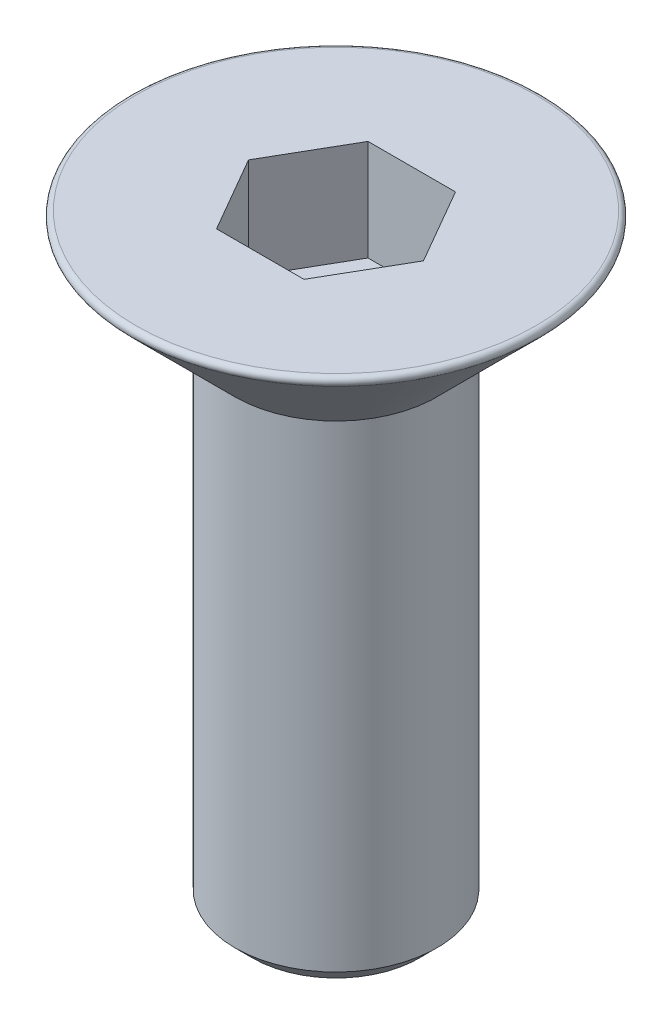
ISO-10303-21;
HEADER;
FILE_DESCRIPTION(('STEP AP214'),'2;1');
FILE_NAME('part.step','',(''),(''),'','','');
FILE_SCHEMA(('AUTOMOTIVE_DESIGN { 1 0 10303 214 1 1 1 1 }'));
ENDSEC;
DATA;
#1=APPLICATION_CONTEXT('core data for automotive mechanical design processes');
#2=APPLICATION_PROTOCOL_DEFINITION('international standard','automotive_design',2000,#1);
#3=PRODUCT_CONTEXT('',#1,'mechanical');
#4=PRODUCT('Part','Part','',(#3));
#5=PRODUCT_RELATED_PRODUCT_CATEGORY('part','',(#4));
#6=PRODUCT_DEFINITION_FORMATION('','',#4);
#7=PRODUCT_DEFINITION_CONTEXT('part definition',#1,'design');
#8=PRODUCT_DEFINITION('design','',#6,#7);
#9=PRODUCT_DEFINITION_SHAPE('','',#8);
#10=(LENGTH_UNIT() NAMED_UNIT(*) SI_UNIT(.MILLI.,.METRE.));
#11=(NAMED_UNIT(*) PLANE_ANGLE_UNIT() SI_UNIT($,.RADIAN.));
#12=(NAMED_UNIT(*) SI_UNIT($,.STERADIAN.) SOLID_ANGLE_UNIT());
#13=UNCERTAINTY_MEASURE_WITH_UNIT(LENGTH_MEASURE(1.E-05),#10,'distance_accuracy_value','');
#14=(GEOMETRIC_REPRESENTATION_CONTEXT(3) GLOBAL_UNCERTAINTY_ASSIGNED_CONTEXT((#13)) GLOBAL_UNIT_ASSIGNED_CONTEXT((#10,
#11,#12)) REPRESENTATION_CONTEXT('',''));
#15=CARTESIAN_POINT('',(0.,0.,0.));
#16=DIRECTION('',(0.,0.,1.));
#17=DIRECTION('',(1.,0.,0.));
#18=AXIS2_PLACEMENT_3D('',#15,#16,#17);
#19=CARTESIAN_POINT('',(0.,0.,0.));
#20=DIRECTION('',(0.,1.,0.));
#21=DIRECTION('',(0.,0.,1.));
#22=AXIS2_PLACEMENT_3D('',#19,#20,#21);
#23=PLANE('',#22);
#24=CARTESIAN_POINT('',(0.,0.,0.));
#25=DIRECTION('',(0.,1.,0.));
#26=DIRECTION('',(0.,0.,1.));
#27=AXIS2_PLACEMENT_3D('',#24,#25,#26);
#28=CIRCLE('',#27,3.95857864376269);
#29=CARTESIAN_POINT('',(0.,0.,3.95857864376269));
#30=VERTEX_POINT('',#29);
#31=EDGE_CURVE('E35',#30,#30,#28,.T.);
#32=ORIENTED_EDGE('',*,*,#31,.T.);
#33=EDGE_LOOP('',(#32));
#34=FACE_BOUND('',#33,.T.);
#35=DIRECTION('',(1.,0.,0.));
#36=VECTOR('',#35,1.);
#37=CARTESIAN_POINT('',(-0.866025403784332,-5.6843418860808E-11,1.5));
#38=LINE('',#37,#36);
#39=CARTESIAN_POINT('',(-0.866025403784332,-5.6843418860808E-11,1.5));
#40=VERTEX_POINT('',#39);
#41=CARTESIAN_POINT('',(0.866025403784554,-1.11022302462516E-13,1.5));
#42=VERTEX_POINT('',#41);
#43=EDGE_CURVE('E42',#40,#42,#38,.T.);
#44=ORIENTED_EDGE('',*,*,#43,.F.);
#45=DIRECTION('',(-0.5,0.,-0.866025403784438));
#46=VECTOR('',#45,1.);
#47=CARTESIAN_POINT('',(-0.866025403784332,-5.6843418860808E-11,1.5));
#48=LINE('',#47,#46);
#49=CARTESIAN_POINT('',(-1.73205080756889,-5.67323965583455E-11,0.));
#50=VERTEX_POINT('',#49);
#51=EDGE_CURVE('E110',#40,#50,#48,.T.);
#52=ORIENTED_EDGE('',*,*,#51,.T.);
#53=DIRECTION('',(-0.5,0.,0.866025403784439));
#54=VECTOR('',#53,1.);
#55=CARTESIAN_POINT('',(-0.866025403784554,-5.6843418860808E-11,-1.5));
#56=LINE('',#55,#54);
#57=CARTESIAN_POINT('',(-0.866025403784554,-5.6843418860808E-11,-1.5));
#58=VERTEX_POINT('',#57);
#59=EDGE_CURVE('E104',#58,#50,#56,.T.);
#60=ORIENTED_EDGE('',*,*,#59,.F.);
#61=DIRECTION('',(1.,0.,0.));
#62=VECTOR('',#61,1.);
#63=CARTESIAN_POINT('',(-0.866025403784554,-5.6843418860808E-11,-1.5));
#64=LINE('',#63,#62);
#65=CARTESIAN_POINT('',(0.866025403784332,-5.69544411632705E-11,-1.5));
#66=VERTEX_POINT('',#65);
#67=EDGE_CURVE('E102',#58,#66,#64,.T.);
#68=ORIENTED_EDGE('',*,*,#67,.T.);
#69=DIRECTION('',(0.5,0.,0.866025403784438));
#70=VECTOR('',#69,1.);
#71=CARTESIAN_POINT('',(0.866025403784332,-5.69544411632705E-11,-1.5));
#72=LINE('',#71,#70);
#73=CARTESIAN_POINT('',(1.73205080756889,-5.71764857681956E-11,0.));
#74=VERTEX_POINT('',#73);
#75=EDGE_CURVE('E85',#66,#74,#72,.T.);
#76=ORIENTED_EDGE('',*,*,#75,.T.);
#77=DIRECTION('',(0.5,0.,-0.866025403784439));
#78=VECTOR('',#77,1.);
#79=CARTESIAN_POINT('',(0.866025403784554,-5.69544411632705E-11,1.5));
#80=LINE('',#79,#78);
#81=EDGE_CURVE('E96',#42,#74,#80,.T.);
#82=ORIENTED_EDGE('',*,*,#81,.F.);
#83=EDGE_LOOP('',(#44,#52,#60,#68,#76,#82));
#84=FACE_BOUND('',#83,.T.);
#85=ADVANCED_FACE('F28',(#34,#84),#23,.T.);
#86=CARTESIAN_POINT('',(0.,0.,0.));
#87=DIRECTION('',(0.,1.,0.));
#88=DIRECTION('',(0.,0.,1.));
#89=AXIS2_PLACEMENT_3D('',#86,#87,#88);
#90=CONICAL_SURFACE('',#89,4.2,0.78539816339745);
#91=CARTESIAN_POINT('',(0.,-0.170710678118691,0.));
#92=DIRECTION('',(0.,-1.,0.));
#93=DIRECTION('',(0.,0.,-1.));
#94=AXIS2_PLACEMENT_3D('',#91,#92,#93);
#95=CIRCLE('',#94,4.02928932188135);
#96=CARTESIAN_POINT('',(0.,-0.170710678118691,-4.02928932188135));
#97=VERTEX_POINT('',#96);
#98=EDGE_CURVE('E11',#97,#97,#95,.T.);
#99=ORIENTED_EDGE('',*,*,#98,.T.);
#100=EDGE_LOOP('',(#99));
#101=FACE_BOUND('',#100,.T.);
#102=CARTESIAN_POINT('',(0.,-2.19999999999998,0.));
#103=DIRECTION('',(0.,1.,0.));
#104=DIRECTION('',(0.,0.,1.));
#105=AXIS2_PLACEMENT_3D('',#102,#103,#104);
#106=CIRCLE('',#105,2.);
#107=CARTESIAN_POINT('',(0.,-2.19999999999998,2.));
#108=VERTEX_POINT('',#107);
#109=EDGE_CURVE('E127',#108,#108,#106,.T.);
#110=ORIENTED_EDGE('',*,*,#109,.T.);
#111=EDGE_LOOP('',(#110));
#112=FACE_BOUND('',#111,.T.);
#113=ADVANCED_FACE('F158',(#101,#112),#90,.T.);
#114=CARTESIAN_POINT('',(-2.22044604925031E-13,7.35066637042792,0.));
#115=DIRECTION('',(0.,1.,0.));
#116=DIRECTION('',(0.,0.,1.));
#117=AXIS2_PLACEMENT_3D('',#114,#115,#116);
#118=CYLINDRICAL_SURFACE('',#117,2.);
#119=CARTESIAN_POINT('',(0.,-11.65,0.));
#120=DIRECTION('',(0.,-1.,0.));
#121=DIRECTION('',(0.,0.,-1.));
#122=AXIS2_PLACEMENT_3D('',#119,#120,#121);
#123=CIRCLE('',#122,2.);
#124=CARTESIAN_POINT('',(0.,-11.65,2.));
#125=VERTEX_POINT('',#124);
#126=EDGE_CURVE('E136',#125,#125,#123,.F.);
#127=ORIENTED_EDGE('',*,*,#126,.T.);
#128=EDGE_LOOP('',(#127));
#129=FACE_BOUND('',#128,.T.);
#130=ORIENTED_EDGE('',*,*,#109,.F.);
#131=EDGE_LOOP('',(#130));
#132=FACE_BOUND('',#131,.T.);
#133=ADVANCED_FACE('F162',(#129,#132),#118,.T.);
#134=CARTESIAN_POINT('',(2.,-12.0000000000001,0.));
#135=DIRECTION('',(0.,-1.,0.));
#136=DIRECTION('',(0.,0.,-1.));
#137=AXIS2_PLACEMENT_3D('',#134,#135,#136);
#138=PLANE('',#137);
#139=CARTESIAN_POINT('',(0.,-12.,0.));
#140=DIRECTION('',(0.,-1.,0.));
#141=DIRECTION('',(0.,0.,-1.));
#142=AXIS2_PLACEMENT_3D('',#139,#140,#141);
#143=CIRCLE('',#142,1.65);
#144=CARTESIAN_POINT('',(0.,-12.,1.65000000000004));
#145=VERTEX_POINT('',#144);
#146=EDGE_CURVE('E139',#145,#145,#143,.T.);
#147=ORIENTED_EDGE('',*,*,#146,.T.);
#148=EDGE_LOOP('',(#147));
#149=FACE_BOUND('',#148,.T.);
#150=ADVANCED_FACE('F167',(#149),#138,.T.);
#151=CARTESIAN_POINT('',(-0.866025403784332,-2.00000000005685,1.5));
#152=DIRECTION('',(0.,0.,1.));
#153=DIRECTION('',(1.,0.,0.));
#154=AXIS2_PLACEMENT_3D('',#151,#152,#153);
#155=PLANE('',#154);
#156=ORIENTED_EDGE('',*,*,#43,.T.);
#157=DIRECTION('',(0.,1.,0.));
#158=VECTOR('',#157,1.);
#159=CARTESIAN_POINT('',(0.866025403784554,-2.00000000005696,1.5));
#160=LINE('',#159,#158);
#161=CARTESIAN_POINT('',(0.866025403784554,-2.00000000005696,1.5));
#162=VERTEX_POINT('',#161);
#163=EDGE_CURVE('E93',#162,#42,#160,.T.);
#164=ORIENTED_EDGE('',*,*,#163,.F.);
#165=DIRECTION('',(1.,0.,0.));
#166=VECTOR('',#165,1.);
#167=CARTESIAN_POINT('',(-0.866025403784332,-2.00000000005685,1.5));
#168=LINE('',#167,#166);
#169=CARTESIAN_POINT('',(-0.866025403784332,-2.00000000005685,1.5));
#170=VERTEX_POINT('',#169);
#171=EDGE_CURVE('E113',#170,#162,#168,.T.);
#172=ORIENTED_EDGE('',*,*,#171,.F.);
#173=DIRECTION('',(0.,1.,0.));
#174=VECTOR('',#173,1.);
#175=CARTESIAN_POINT('',(-0.866025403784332,-2.00000000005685,1.5));
#176=LINE('',#175,#174);
#177=EDGE_CURVE('E49',#170,#40,#176,.T.);
#178=ORIENTED_EDGE('',*,*,#177,.T.);
#179=EDGE_LOOP('',(#156,#164,#172,#178));
#180=FACE_BOUND('',#179,.T.);
#181=ADVANCED_FACE('F174',(#180),#155,.F.);
#182=CARTESIAN_POINT('',(-0.866025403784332,-2.00000000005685,1.5));
#183=DIRECTION('',(0.866025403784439,0.,-0.5));
#184=DIRECTION('',(-0.5,0.,-0.866025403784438));
#185=AXIS2_PLACEMENT_3D('',#182,#183,#184);
#186=PLANE('',#185);
#187=ORIENTED_EDGE('',*,*,#51,.F.);
#188=ORIENTED_EDGE('',*,*,#177,.F.);
#189=DIRECTION('',(-0.5,0.,-0.866025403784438));
#190=VECTOR('',#189,1.);
#191=CARTESIAN_POINT('',(-0.866025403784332,-2.00000000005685,1.5));
#192=LINE('',#191,#190);
#193=CARTESIAN_POINT('',(-1.73205080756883,-2.00000000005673,0.));
#194=VERTEX_POINT('',#193);
#195=EDGE_CURVE('E124',#170,#194,#192,.T.);
#196=ORIENTED_EDGE('',*,*,#195,.T.);
#197=DIRECTION('',(0.,1.,0.));
#198=VECTOR('',#197,1.);
#199=CARTESIAN_POINT('',(-1.73205080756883,-2.00000000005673,0.));
#200=LINE('',#199,#198);
#201=EDGE_CURVE('E128',#194,#50,#200,.T.);
#202=ORIENTED_EDGE('',*,*,#201,.T.);
#203=EDGE_LOOP('',(#187,#188,#196,#202));
#204=FACE_BOUND('',#203,.T.);
#205=ADVANCED_FACE('F178',(#204),#186,.T.);
#206=CARTESIAN_POINT('',(-0.866025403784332,-2.00000000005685,-1.5));
#207=DIRECTION('',(-0.866025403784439,0.,-0.499999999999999));
#208=DIRECTION('',(-0.5,0.,0.866025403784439));
#209=AXIS2_PLACEMENT_3D('',#206,#207,#208);
#210=PLANE('',#209);
#211=ORIENTED_EDGE('',*,*,#59,.T.);
#212=ORIENTED_EDGE('',*,*,#201,.F.);
#213=DIRECTION('',(-0.5,0.,0.866025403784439));
#214=VECTOR('',#213,1.);
#215=CARTESIAN_POINT('',(-0.866025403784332,-2.00000000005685,-1.5));
#216=LINE('',#215,#214);
#217=CARTESIAN_POINT('',(-0.866025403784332,-2.00000000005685,-1.5));
#218=VERTEX_POINT('',#217);
#219=EDGE_CURVE('E121',#218,#194,#216,.T.);
#220=ORIENTED_EDGE('',*,*,#219,.F.);
#221=DIRECTION('',(0.,1.,0.));
#222=VECTOR('',#221,1.);
#223=CARTESIAN_POINT('',(-0.866025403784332,-2.00000000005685,-1.5));
#224=LINE('',#223,#222);
#225=EDGE_CURVE('E130',#218,#58,#224,.T.);
#226=ORIENTED_EDGE('',*,*,#225,.T.);
#227=EDGE_LOOP('',(#211,#212,#220,#226));
#228=FACE_BOUND('',#227,.T.);
#229=ADVANCED_FACE('F186',(#228),#210,.F.);
#230=CARTESIAN_POINT('',(-0.866025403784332,-2.00000000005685,-1.5));
#231=DIRECTION('',(0.,0.,1.));
#232=DIRECTION('',(1.,0.,0.));
#233=AXIS2_PLACEMENT_3D('',#230,#231,#232);
#234=PLANE('',#233);
#235=ORIENTED_EDGE('',*,*,#67,.F.);
#236=ORIENTED_EDGE('',*,*,#225,.F.);
#237=DIRECTION('',(1.,0.,0.));
#238=VECTOR('',#237,1.);
#239=CARTESIAN_POINT('',(-0.866025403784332,-2.00000000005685,-1.5));
#240=LINE('',#239,#238);
#241=CARTESIAN_POINT('',(0.866025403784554,-2.00000000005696,-1.5));
#242=VERTEX_POINT('',#241);
#243=EDGE_CURVE('E119',#218,#242,#240,.T.);
#244=ORIENTED_EDGE('',*,*,#243,.T.);
#245=DIRECTION('',(0.,1.,0.));
#246=VECTOR('',#245,1.);
#247=CARTESIAN_POINT('',(0.866025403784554,-2.00000000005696,-1.5));
#248=LINE('',#247,#246);
#249=EDGE_CURVE('E92',#242,#66,#248,.T.);
#250=ORIENTED_EDGE('',*,*,#249,.T.);
#251=EDGE_LOOP('',(#235,#236,#244,#250));
#252=FACE_BOUND('',#251,.T.);
#253=ADVANCED_FACE('F183',(#252),#234,.T.);
#254=CARTESIAN_POINT('',(0.866025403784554,-2.00000000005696,-1.5));
#255=DIRECTION('',(-0.866025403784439,0.,0.5));
#256=DIRECTION('',(0.5,0.,0.866025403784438));
#257=AXIS2_PLACEMENT_3D('',#254,#255,#256);
#258=PLANE('',#257);
#259=ORIENTED_EDGE('',*,*,#75,.F.);
#260=ORIENTED_EDGE('',*,*,#249,.F.);
#261=DIRECTION('',(0.5,0.,0.866025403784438));
#262=VECTOR('',#261,1.);
#263=CARTESIAN_POINT('',(0.866025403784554,-2.00000000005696,-1.5));
#264=LINE('',#263,#262);
#265=CARTESIAN_POINT('',(1.73205080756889,-2.00000000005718,0.));
#266=VERTEX_POINT('',#265);
#267=EDGE_CURVE('E88',#242,#266,#264,.T.);
#268=ORIENTED_EDGE('',*,*,#267,.T.);
#269=DIRECTION('',(0.,1.,0.));
#270=VECTOR('',#269,1.);
#271=CARTESIAN_POINT('',(1.73205080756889,-2.00000000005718,0.));
#272=LINE('',#271,#270);
#273=EDGE_CURVE('E80',#266,#74,#272,.T.);
#274=ORIENTED_EDGE('',*,*,#273,.T.);
#275=EDGE_LOOP('',(#259,#260,#268,#274));
#276=FACE_BOUND('',#275,.T.);
#277=ADVANCED_FACE('F82',(#276),#258,.T.);
#278=CARTESIAN_POINT('',(0.866025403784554,-2.00000000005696,1.5));
#279=DIRECTION('',(0.866025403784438,0.,0.5));
#280=DIRECTION('',(0.5,0.,-0.866025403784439));
#281=AXIS2_PLACEMENT_3D('',#278,#279,#280);
#282=PLANE('',#281);
#283=ORIENTED_EDGE('',*,*,#81,.T.);
#284=ORIENTED_EDGE('',*,*,#273,.F.);
#285=DIRECTION('',(0.5,0.,-0.866025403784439));
#286=VECTOR('',#285,1.);
#287=CARTESIAN_POINT('',(0.866025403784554,-2.00000000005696,1.5));
#288=LINE('',#287,#286);
#289=EDGE_CURVE('E116',#162,#266,#288,.T.);
#290=ORIENTED_EDGE('',*,*,#289,.F.);
#291=ORIENTED_EDGE('',*,*,#163,.T.);
#292=EDGE_LOOP('',(#283,#284,#290,#291));
#293=FACE_BOUND('',#292,.T.);
#294=ADVANCED_FACE('F97',(#293),#282,.F.);
#295=CARTESIAN_POINT('',(-2.59807621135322,-2.00000000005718,1.5));
#296=DIRECTION('',(0.,-1.,0.));
#297=DIRECTION('',(0.,0.,-1.));
#298=AXIS2_PLACEMENT_3D('',#295,#296,#297);
#299=PLANE('',#298);
#300=ORIENTED_EDGE('',*,*,#171,.T.);
#301=ORIENTED_EDGE('',*,*,#289,.T.);
#302=ORIENTED_EDGE('',*,*,#267,.F.);
#303=ORIENTED_EDGE('',*,*,#243,.F.);
#304=ORIENTED_EDGE('',*,*,#219,.T.);
#305=ORIENTED_EDGE('',*,*,#195,.F.);
#306=EDGE_LOOP('',(#300,#301,#302,#303,#304,#305));
#307=FACE_BOUND('',#306,.T.);
#308=ADVANCED_FACE('F153',(#307),#299,.F.);
#309=CARTESIAN_POINT('',(0.,-11.65,0.));
#310=DIRECTION('',(0.,1.,0.));
#311=DIRECTION('',(0.,0.,1.));
#312=AXIS2_PLACEMENT_3D('',#309,#310,#311);
#313=CONICAL_SURFACE('',#312,2.,0.78539816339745);
#314=CARTESIAN_POINT('',(0.,-12.,1.65000000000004));
#315=CARTESIAN_POINT('',(0.,-11.9963541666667,1.65364583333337));
#316=CARTESIAN_POINT('',(0.,-11.9927083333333,1.65729166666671));
#317=CARTESIAN_POINT('',(0.,-11.9854166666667,1.66458333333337));
#318=CARTESIAN_POINT('',(0.,-11.9817708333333,1.6682291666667));
#319=CARTESIAN_POINT('',(0.,-11.9744791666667,1.67552083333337));
#320=CARTESIAN_POINT('',(0.,-11.9708333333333,1.6791666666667));
#321=CARTESIAN_POINT('',(0.,-11.9635416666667,1.68645833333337));
#322=CARTESIAN_POINT('',(0.,-11.9598958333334,1.6901041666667));
#323=CARTESIAN_POINT('',(0.,-11.9526041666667,1.69739583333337));
#324=CARTESIAN_POINT('',(0.,-11.9489583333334,1.7010416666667));
#325=CARTESIAN_POINT('',(0.,-11.9416666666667,1.70833333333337));
#326=CARTESIAN_POINT('',(0.,-11.9380208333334,1.7119791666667));
#327=CARTESIAN_POINT('',(0.,-11.9307291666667,1.71927083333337));
#328=CARTESIAN_POINT('',(0.,-11.9270833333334,1.7229166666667));
#329=CARTESIAN_POINT('',(0.,-11.9197916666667,1.73020833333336));
#330=CARTESIAN_POINT('',(0.,-11.9161458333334,1.7338541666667));
#331=CARTESIAN_POINT('',(0.,-11.9088541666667,1.74114583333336));
#332=CARTESIAN_POINT('',(0.,-11.9052083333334,1.7447916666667));
#333=CARTESIAN_POINT('',(0.,-11.8979166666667,1.75208333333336));
#334=CARTESIAN_POINT('',(0.,-11.8942708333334,1.75572916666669));
#335=CARTESIAN_POINT('',(0.,-11.8869791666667,1.76302083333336));
#336=CARTESIAN_POINT('',(0.,-11.8833333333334,1.76666666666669));
#337=CARTESIAN_POINT('',(0.,-11.8760416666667,1.77395833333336));
#338=CARTESIAN_POINT('',(0.,-11.8723958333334,1.77760416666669));
#339=CARTESIAN_POINT('',(0.,-11.8651041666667,1.78489583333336));
#340=CARTESIAN_POINT('',(0.,-11.8614583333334,1.78854166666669));
#341=CARTESIAN_POINT('',(0.,-11.8541666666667,1.79583333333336));
#342=CARTESIAN_POINT('',(0.,-11.8505208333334,1.79947916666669));
#343=CARTESIAN_POINT('',(0.,-11.8432291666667,1.80677083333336));
#344=CARTESIAN_POINT('',(0.,-11.8395833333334,1.81041666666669));
#345=CARTESIAN_POINT('',(0.,-11.8322916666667,1.81770833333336));
#346=CARTESIAN_POINT('',(0.,-11.8286458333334,1.82135416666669));
#347=CARTESIAN_POINT('',(0.,-11.8213541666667,1.82864583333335));
#348=CARTESIAN_POINT('',(0.,-11.8177083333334,1.83229166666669));
#349=CARTESIAN_POINT('',(0.,-11.8104166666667,1.83958333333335));
#350=CARTESIAN_POINT('',(0.,-11.8067708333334,1.84322916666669));
#351=CARTESIAN_POINT('',(0.,-11.7994791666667,1.85052083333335));
#352=CARTESIAN_POINT('',(0.,-11.7958333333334,1.85416666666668));
#353=CARTESIAN_POINT('',(0.,-11.7885416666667,1.86145833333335));
#354=CARTESIAN_POINT('',(0.,-11.7848958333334,1.86510416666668));
#355=CARTESIAN_POINT('',(0.,-11.7776041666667,1.87239583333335));
#356=CARTESIAN_POINT('',(0.,-11.7739583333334,1.87604166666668));
#357=CARTESIAN_POINT('',(0.,-11.7666666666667,1.88333333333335));
#358=CARTESIAN_POINT('',(0.,-11.7630208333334,1.88697916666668));
#359=CARTESIAN_POINT('',(0.,-11.7557291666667,1.89427083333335));
#360=CARTESIAN_POINT('',(0.,-11.7520833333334,1.89791666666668));
#361=CARTESIAN_POINT('',(0.,-11.7447916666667,1.90520833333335));
#362=CARTESIAN_POINT('',(0.,-11.7411458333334,1.90885416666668));
#363=CARTESIAN_POINT('',(0.,-11.7338541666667,1.91614583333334));
#364=CARTESIAN_POINT('',(0.,-11.7302083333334,1.91979166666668));
#365=CARTESIAN_POINT('',(0.,-11.7229166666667,1.92708333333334));
#366=CARTESIAN_POINT('',(0.,-11.7192708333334,1.93072916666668));
#367=CARTESIAN_POINT('',(0.,-11.7119791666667,1.93802083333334));
#368=CARTESIAN_POINT('',(0.,-11.7083333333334,1.94166666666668));
#369=CARTESIAN_POINT('',(0.,-11.7010416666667,1.94895833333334));
#370=CARTESIAN_POINT('',(0.,-11.6973958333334,1.95260416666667));
#371=CARTESIAN_POINT('',(0.,-11.6901041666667,1.95989583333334));
#372=CARTESIAN_POINT('',(0.,-11.6864583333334,1.96354166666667));
#373=CARTESIAN_POINT('',(0.,-11.6791666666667,1.97083333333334));
#374=CARTESIAN_POINT('',(0.,-11.6755208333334,1.97447916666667));
#375=CARTESIAN_POINT('',(0.,-11.6682291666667,1.98177083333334));
#376=CARTESIAN_POINT('',(0.,-11.6645833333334,1.98541666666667));
#377=CARTESIAN_POINT('',(0.,-11.6572916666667,1.99270833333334));
#378=CARTESIAN_POINT('',(0.,-11.6536458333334,1.99635416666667));
#379=CARTESIAN_POINT('',(0.,-11.65,2.));
#380=B_SPLINE_CURVE_WITH_KNOTS('',3,(#314,#315,#316,#317,#318,#319,#320,#321,#322,#323,#324,
#325,#326,#327,#328,#329,#330,#331,#332,#333,#334,#335,#336,#337,#338,#339,#340,#341,#342,#343,
#344,#345,#346,#347,#348,#349,#350,#351,#352,#353,#354,#355,#356,#357,#358,#359,#360,#361,#362,
#363,#364,#365,#366,#367,#368,#369,#370,#371,#372,#373,#374,#375,#376,#377,#378,#379),
.UNSPECIFIED.,.F.,.F.,(4,2,2,2,2,2,2,2,2,2,2,2,2,2,2,2,2,2,2,2,2,2,2,2,2,2,2,2,2,2,2,2,4),(0.,
0.015467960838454,0.030935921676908,0.0464038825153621,0.0618718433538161,0.0773398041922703,
0.0928077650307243,0.108275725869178,0.123743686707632,0.139211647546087,0.154679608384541,
0.170147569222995,0.185615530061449,0.201083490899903,0.216551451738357,0.232019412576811,
0.247487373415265,0.262955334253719,0.278423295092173,0.293891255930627,0.309359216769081,
0.324827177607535,0.340295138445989,0.355763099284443,0.371231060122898,0.386699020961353,
0.402166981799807,0.417634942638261,0.433102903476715,0.448570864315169,0.464038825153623,
0.479506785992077,0.494974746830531),.UNSPECIFIED.);
#381=EDGE_CURVE('BSEAM147',#145,#125,#380,.T.);
#382=ORIENTED_EDGE('',*,*,#146,.F.);
#383=ORIENTED_EDGE('',*,*,#126,.F.);
#384=ORIENTED_EDGE('',*,*,#381,.T.);
#385=ORIENTED_EDGE('',*,*,#381,.F.);
#386=EDGE_LOOP('',(#382,#384,#383,#385));
#387=FACE_BOUND('',#386,.T.);
#388=ADVANCED_FACE('F147',(#387),#313,.T.);
#389=CARTESIAN_POINT('',(0.,-0.099999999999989,0.));
#390=DIRECTION('',(0.,1.,0.));
#391=DIRECTION('',(0.,0.,1.));
#392=AXIS2_PLACEMENT_3D('',#389,#390,#391);
#393=TOROIDAL_SURFACE('',#392,3.95857864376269,0.1);
#394=ORIENTED_EDGE('',*,*,#98,.F.);
#395=EDGE_LOOP('',(#394));
#396=FACE_BOUND('',#395,.T.);
#397=ORIENTED_EDGE('',*,*,#31,.F.);
#398=EDGE_LOOP('',(#397));
#399=FACE_BOUND('',#398,.T.);
#400=ADVANCED_FACE('F145',(#396,#399),#393,.T.);
#401=CLOSED_SHELL('',(#85,#113,#133,#150,#181,#205,#229,#253,#277,#294,#308,#388,#400));
#402=MANIFOLD_SOLID_BREP('B2',#401);
#403=ADVANCED_BREP_SHAPE_REPRESENTATION('',(#18,#402),#14);
#404=SHAPE_DEFINITION_REPRESENTATION(#9,#403);
ENDSEC;
END-ISO-10303-21;
